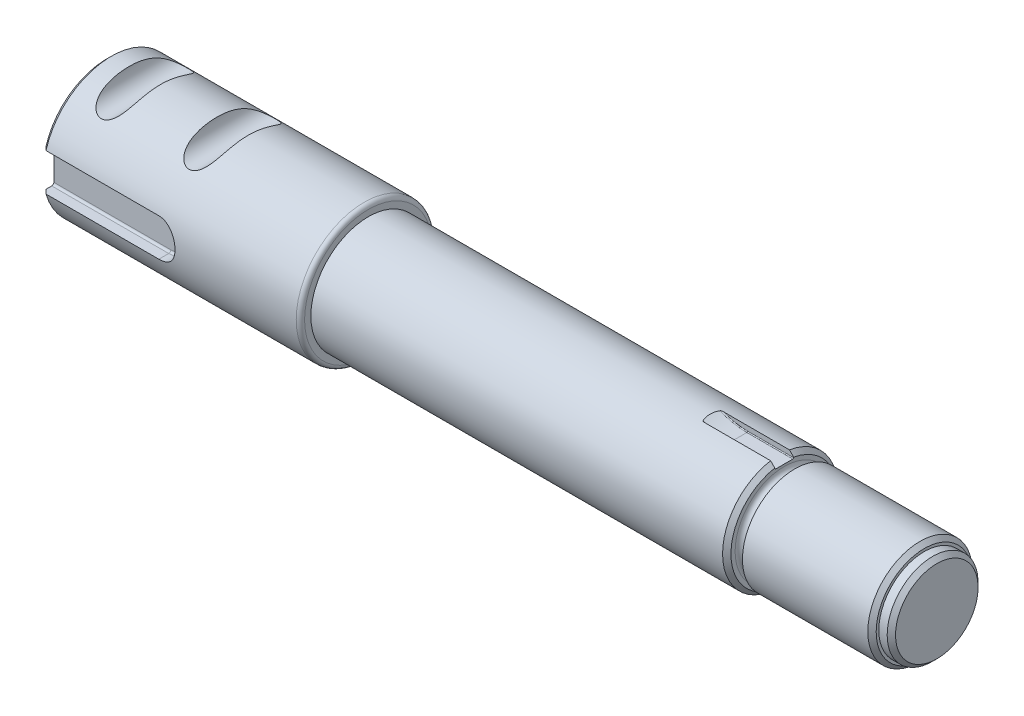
from build123d import *

# Parameters (mm, degrees)
CHANFREIN1_SIZE  = 2
CONG_1_R         = 2
CHANFREIN2_SIZE  = 2
ESQUISSE5_R      = 7.5
EXTRUSION3_DEPTH = 76
EXTRUSION4_DEPTH = 7
EXTRUSION5_DEPTH = 4.5
CONG_2_R         = 1
CONG_3_R         = 0.4


with BuildPart() as part:
    # Esquisse4 → R_volution1 (revolve)
    with BuildSketch(Plane.XY, mode=Mode.PRIVATE) as r_volution1_sk:
        with BuildLine():
            Line((0, 32.5), (0, 0))
            Line((0, 0), (397, 0))
            Line((397, 0), (397, 21.75))
            Line((397, 21.75), (391, 21.75))
            Line((391, 21.75), (391, 25))
            Line((391, 25), (329, 25))
            Line((329, 25), (329, 23.5))
            ThreePointArc((329, 23.5), (326.5, 21), (324, 23.5))
            Line((324, 23.5), (324, 25.5))
            Line((324, 25.5), (322, 27.5))
            Line((322, 27.5), (125, 27.5))
            Line((125, 27.5), (125, 32.5))
            Line((125, 32.5), (0, 32.5))
        make_face()
    revolve(r_volution1_sk.sketch.rotate(Axis((0, 0, 0), (1, 0, 0)), 90), axis=Axis((0, 0, 0), (1, 0, 0)))

    # Chanfrein1
    chanfrein1_edges = [part.edges().sort_by_distance(p)[0] for p in [
        (391, 0, -25),
        (397, 0, -21.75),
    ]]
    chamfer(chanfrein1_edges, length=CHANFREIN1_SIZE)

    # Cong_1
    cong_1_edges = [part.edges().sort_by_distance(p)[0] for p in [
        (125, 0, -32.5),
    ]]
    fillet(cong_1_edges, radius=CONG_1_R)

    # Chanfrein2
    chanfrein2_edges = [part.edges().sort_by_distance(p)[0] for p in [
        (0, 0, -32.5),
    ]]
    chamfer(chanfrein2_edges, length=CHANFREIN2_SIZE)

    # Esquisse5 → Extrusion3 (cut, symmetric)
    with BuildSketch(Plane.XY):
        with Locations((18, 32.5)):
            Circle(ESQUISSE5_R)
        with Locations((60, 32.5)):
            Circle(ESQUISSE5_R)
        with Locations((18, -32.5)):
            Circle(ESQUISSE5_R)
        with Locations((60, -32.5)):
            Circle(ESQUISSE5_R)
    extrude(amount=EXTRUSION3_DEPTH, both=True, mode=Mode.SUBTRACT)

    # Esquisse6 → Extrusion4 (cut)
    with BuildSketch(Plane.XY.offset(32.5)):
        with BuildLine():
            Line((0, 9), (56, 9))
            ThreePointArc((56, 9), (65, 0), (56, -9))
            Line((56, -9), (0, -9))
            Line((0, -9), (0, 9))
        make_face()
    extrude(amount=-EXTRUSION4_DEPTH, mode=Mode.SUBTRACT)

    # Esquisse7 → Extrusion5 (cut, symmetric)
    with BuildSketch(Plane.XY):
        with BuildLine():
            Line((324, 24.5), (302, 24.5))
            ThreePointArc((302, 24.5), (283.131726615, 30.776236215), (271.782293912, 47.103920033))
            Line((271.782293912, 47.103920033), (324, 47.103920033))
            Line((324, 47.103920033), (324, 24.5))
        make_face()
    extrude(amount=EXTRUSION5_DEPTH, both=True, mode=Mode.SUBTRACT)

    # Cong_2
    cong_2_edges = [part.edges().sort_by_distance(p)[0] for p in [
        (65, 0, 25.5),
        (28, 9, 25.5),
        (28, -9, 25.5),
    ]]
    fillet(cong_2_edges, radius=CONG_2_R)

    # Cong_3
    cong_3_edges = [part.edges().sort_by_distance(p)[0] for p in [
        (295.564800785, 25.164335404, 4.5),
        (295.564800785, 25.164335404, -4.5),
        (313, 24.5, 4.5),
        (313, 24.5, -4.5),
    ]]
    fillet(cong_3_edges, radius=CONG_3_R)


solid = part.part
